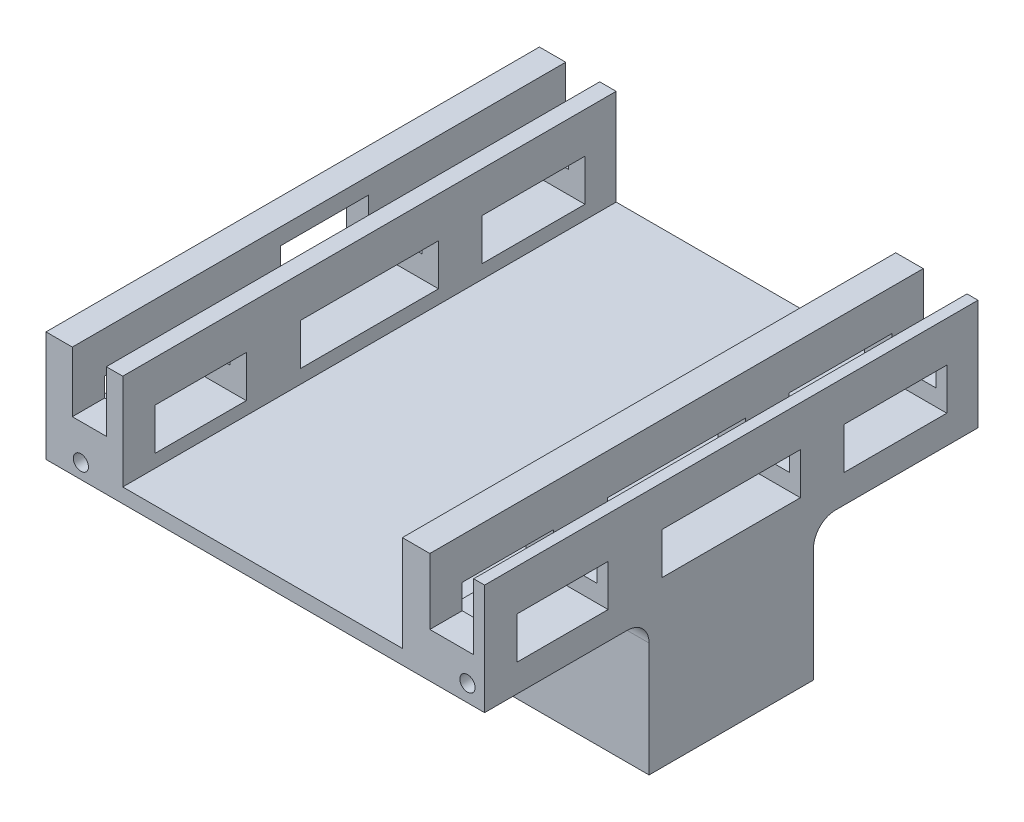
from build123d import *

# Parameters (mm, degrees)
SKETCH1_W                = 50.8
SKETCH1_H                = 19.05
BOSS_EXTRUDE1_DEPTH      = 19.05
SKETCH3_R                = 3.175
CUT_EXTRUDE1_DEPTH       = 58.501695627
SKETCH4_R                = 3.130247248
CUT_EXTRUDE3_DEPTH       = 58.501695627
SKETCH6_W                = 35.56
SKETCH6_H                = 19.05
BOSS_EXTRUDE2_DEPTH      = 9.525
BOSS_EXTRUDE3_DEPTH      = 19.05
BOSS_EXTRUDE3_DEPTH_BACK = 38.1
SKETCH7_W                = 35.56
SKETCH7_H                = 12.798350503
SKETCH8_W                = 10.5630274
SKETCH8_H                = 4.83721382
CUT_EXTRUDE4_DEPTH       = 37.846
SKETCH9_W                = 11.912020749
SKETCH9_H                = 4.826
CUT_EXTRUDE5_DEPTH       = 37.846
SKETCH10_W               = 13.208
SKETCH10_H               = 7.815498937
CUT_EXTRUDE6_DEPTH       = 204.724
SKETCH12_W               = 57.15
SKETCH12_H               = 12.798350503
SKETCH12_W_2             = 10.5630274
SKETCH12_H_2             = 4.83721382
SKETCH12_W_3             = 11.912020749
SKETCH12_H_3             = 4.826
BOSS_EXTRUDE4_DEPTH      = 7.62
SKETCH13_W               = 57.15
SKETCH13_H               = 12.798350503
SKETCH13_W_2             = 10.5630274
SKETCH13_H_2             = 4.83721382
SKETCH13_W_3             = 11.912020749
SKETCH13_H_3             = 4.826
BOSS_EXTRUDE5_DEPTH      = 7.62
CUT_EXTRUDE7_DEPTH       = 70.633186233
CUT_EXTRUDE7_DEPTH_BACK  = 70.633186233
SKETCH14_W               = 16.002
SKETCH14_H               = 4.826
SKETCH15_W               = 38.1
SKETCH15_H               = 57.15
CUT_EXTRUDE9_DEPTH       = 11.1125
SKETCH16_W               = 1.27
SKETCH16_H               = 57.15
CUT_EXTRUDE10_DEPTH      = 7.62
SKETCH17_W               = 3.937
SKETCH17_H               = 6.985
CUT_EXTRUDE12_DEPTH      = 82.628996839
SKETCH18_W               = 16.002
SKETCH18_H               = 4.826
BOSS_EXTRUDE6_DEPTH      = 3.048
SKETCH19_W               = 10.16
SKETCH19_H               = 6.35
CUT_EXTRUDE13_DEPTH      = 4.7625
FILLET1_R                = 2.54
FILLET3_R                = 2.54
SKETCH21_W               = 3.65125
SKETCH21_H               = 6.35
CUT_EXTRUDE14_DEPTH      = 0.508
SKETCH22_W               = 3.96875
SKETCH22_H               = 6.364366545
CUT_EXTRUDE15_DEPTH      = 0.508
SKETCH23_R               = 0.884360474
CUT_EXTRUDE16_DEPTH      = 5.08
SKETCH24_R               = 0.880410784
CUT_EXTRUDE17_DEPTH      = 5.08
SKETCH25_R               = 3.4925
CUT_EXTRUDE18_DEPTH      = 70.633186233
SKETCH26_W               = 57.15
SKETCH26_H               = 11.1125
BOSS_EXTRUDE8_DEPTH      = 12.192
SKETCH28_W               = 32.385
SKETCH28_H               = 11.1125
CUT_EXTRUDE19_DEPTH      = 68.58
SKETCH29_W               = 5.071446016
SKETCH29_H               = 7.62
CUT_EXTRUDE20_DEPTH      = 68.58
SKETCH30_W               = 10.5630274
SKETCH30_H               = 4.83721382
SKETCH30_W_2             = 16.002
SKETCH30_H_2             = 4.826
SKETCH30_W_3             = 11.912020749
CUT_EXTRUDE21_DEPTH      = 12.7
BOSS_EXTRUDE10_START     = -19.05
SKETCH31_R               = 3.4925
SKETCH31_R_2             = 3.302
BOSS_EXTRUDE10_DEPTH     = 19.05
BOSS_EXTRUDE12_START     = -19.05
SKETCH32_R               = 3.4925
SKETCH32_R_2             = 3.302
BOSS_EXTRUDE12_DEPTH     = 19.05


with BuildPart() as part:
    # Sketch1 → Boss-Extrude1 (new body)
    with BuildSketch(Plane.XY):
        with Locations((25.4, 9.525)):
            Rectangle(SKETCH1_W, SKETCH1_H)
    extrude(amount=BOSS_EXTRUDE1_DEPTH)

    # Sketch3 → Cut-Extrude1 (cut, through all)
    with BuildSketch(Plane.XY.offset(19.05)):
        with Locations((12.7, 9.525)):
            Circle(SKETCH3_R)
    extrude(amount=-CUT_EXTRUDE1_DEPTH, mode=Mode.SUBTRACT)

    # Sketch4 → Cut-Extrude3 (cut, through all)
    with BuildSketch(Plane.XY.offset(19.05)):
        with Locations((38.1, 9.525)):
            Circle(SKETCH4_R)
    extrude(amount=-CUT_EXTRUDE3_DEPTH, mode=Mode.SUBTRACT)

    # Sketch6 → Boss-Extrude2 (add)
    with BuildSketch(Plane(origin=(0, 19.05, 0), x_dir=(1, 0, 0), z_dir=(0, 1, 0))):
        with Locations((25.4, -9.525)):
            Rectangle(SKETCH6_W, SKETCH6_H)
    extrude(amount=BOSS_EXTRUDE2_DEPTH)

    # Sketch7 → Boss-Extrude3 (add, two sides: drawn at the far end of the back side and taken through both)
    with BuildSketch(Plane.XY.offset(19.05).offset(-BOSS_EXTRUDE3_DEPTH_BACK)):
        with Locations((25.4, 22.175824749)):
            Rectangle(SKETCH7_W, SKETCH7_H)
    extrude(amount=BOSS_EXTRUDE3_DEPTH + BOSS_EXTRUDE3_DEPTH_BACK)

    # Sketch8 → Cut-Extrude4 (cut)
    with BuildSketch(Plane(origin=(43.18, 0, 0), x_dir=(0, 0, -1), z_dir=(1, 0, 0))):
        with Locations((-29.071363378, 21.383689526)):
            Rectangle(SKETCH8_W, SKETCH8_H)
    extrude(amount=-CUT_EXTRUDE4_DEPTH, mode=Mode.SUBTRACT)

    # Sketch9 → Cut-Extrude5 (cut)
    with BuildSketch(Plane.ZY.offset(-7.62)):
        with Locations((-9.479585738, 21.463)):
            Rectangle(SKETCH9_W, SKETCH9_H)
    extrude(amount=-CUT_EXTRUDE5_DEPTH, mode=Mode.SUBTRACT)

    # Sketch10 → Cut-Extrude6 (cut)
    with BuildSketch(Plane(origin=(0, 0, -19.05), x_dir=(-1, 0, 0), z_dir=(0, 0, -1))):
        with Locations((-33.528, 22.128754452)):
            Rectangle(SKETCH10_W, SKETCH10_H)
        with Locations((-17.272, 22.128754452)):
            Rectangle(SKETCH10_W, SKETCH10_H)
    extrude(amount=-CUT_EXTRUDE6_DEPTH, mode=Mode.SUBTRACT)

    # Sketch12 → Boss-Extrude4 (add)
    with BuildSketch(Plane(origin=(43.18, 0, 0), x_dir=(0, 0, -1), z_dir=(1, 0, 0))):
        with Locations((-9.525, 22.175824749)):
            Rectangle(SKETCH12_W, SKETCH12_H)
        with Locations((-29.071363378, 21.383689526)):
            Rectangle(SKETCH12_W_2, SKETCH12_H_2, mode=Mode.SUBTRACT)
        with Locations((9.479585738, 21.463)):
            Rectangle(SKETCH12_W_3, SKETCH12_H_3, mode=Mode.SUBTRACT)
    extrude(amount=BOSS_EXTRUDE4_DEPTH)

    # Sketch13 → Boss-Extrude5 (add)
    with BuildSketch(Plane.ZY.offset(-7.62)):
        with Locations((9.525, 22.175824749)):
            Rectangle(SKETCH13_W, SKETCH13_H)
        with Locations((29.071363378, 21.383689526)):
            Rectangle(SKETCH13_W_2, SKETCH13_H_2, mode=Mode.SUBTRACT)
        with Locations((-9.479585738, 21.463)):
            Rectangle(SKETCH13_W_3, SKETCH13_H_3, mode=Mode.SUBTRACT)
    extrude(amount=BOSS_EXTRUDE5_DEPTH)

    # Sketch14 → Cut-Extrude7 (cut, two sides: drawn at the far end of the back side and taken through both)
    with BuildSketch(Plane(origin=(50.8, 0, 0), x_dir=(0, 0, -1), z_dir=(1, 0, 0)).offset(-CUT_EXTRUDE7_DEPTH_BACK)):
        with Locations((-9.525, 21.463)):
            Rectangle(SKETCH14_W, SKETCH14_H)
    extrude(amount=CUT_EXTRUDE7_DEPTH + CUT_EXTRUDE7_DEPTH_BACK, mode=Mode.SUBTRACT)

    # Sketch15 → Cut-Extrude9 (cut)
    with BuildSketch(Plane(origin=(0, 28.575, 0), x_dir=(1, 0, 0), z_dir=(0, 1, 0))):
        with Locations((27.94, -9.525)):
            Rectangle(SKETCH15_W, SKETCH15_H)
    extrude(amount=-CUT_EXTRUDE9_DEPTH, mode=Mode.SUBTRACT)

    # Sketch16 → Cut-Extrude10 (cut)
    with BuildSketch(Plane(origin=(0, 28.575, 0), x_dir=(1, 0, 0), z_dir=(0, 1, 0))):
        with Locations((48.895, -9.525)):
            Rectangle(SKETCH16_W, SKETCH16_H)
    extrude(amount=-CUT_EXTRUDE10_DEPTH, mode=Mode.SUBTRACT)

    # Sketch17 → Cut-Extrude12 (cut, through all)
    with BuildSketch(Plane.XY.offset(38.1)):
        with Locations((5.0165, 25.0825)):
            Rectangle(SKETCH17_W, SKETCH17_H)
    extrude(amount=-CUT_EXTRUDE12_DEPTH, mode=Mode.SUBTRACT)

    # Sketch18 → Boss-Extrude6 (add)
    with BuildSketch(Plane.ZY):
        with Locations((9.525, 21.463)):
            Rectangle(SKETCH18_W, SKETCH18_H)
    extrude(amount=-BOSS_EXTRUDE6_DEPTH)

    # Sketch19 → Cut-Extrude13 (cut)
    with BuildSketch(Plane.ZY):
        with Locations((8.89, 23.495)):
            Rectangle(SKETCH19_W, SKETCH19_H)
    extrude(amount=-CUT_EXTRUDE13_DEPTH, mode=Mode.SUBTRACT)

    # Fillet1
    fillet1_edges = [part.edges().sort_by_distance(p)[0] for p in [
        (25.4, 15.776649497, 0),
    ]]
    fillet(fillet1_edges, radius=FILLET1_R)

    # Fillet3
    fillet3_edges = [part.edges().sort_by_distance(p)[0] for p in [
        (25.4, 15.776649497, 19.05),
    ]]
    fillet(fillet3_edges, radius=FILLET3_R)

    # Sketch21 → Cut-Extrude14 (cut)
    with BuildSketch(Plane.ZY):
        with Locations((1.984375, 23.495)):
            Rectangle(SKETCH21_W, SKETCH21_H)
    extrude(amount=-CUT_EXTRUDE14_DEPTH, mode=Mode.SUBTRACT)

    # Sketch22 → Cut-Extrude15 (cut)
    with BuildSketch(Plane.ZY):
        with Locations((15.954375, 23.502183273)):
            Rectangle(SKETCH22_W, SKETCH22_H)
    extrude(amount=-CUT_EXTRUDE15_DEPTH, mode=Mode.SUBTRACT)

    # Sketch23 → Cut-Extrude16 (cut)
    with BuildSketch(Plane.XY.offset(38.1)):
        with Locations((48.820923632, 17.729657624)):
            Circle(SKETCH23_R)
    extrude(amount=-CUT_EXTRUDE16_DEPTH, mode=Mode.SUBTRACT)

    # Sketch24 → Cut-Extrude17 (cut)
    with BuildSketch(Plane.XY.offset(38.1)):
        with Locations((4.037534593, 17.487623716)):
            Circle(SKETCH24_R)
    extrude(amount=-CUT_EXTRUDE17_DEPTH, mode=Mode.SUBTRACT)

    # Sketch25 → Cut-Extrude18 (cut, through all)
    with BuildSketch(Plane.XY.offset(19.05)):
        with Locations((12.7, 9.525)):
            Circle(SKETCH25_R)
        with Locations((38.1, 9.525)):
            Circle(SKETCH25_R)
    extrude(amount=-CUT_EXTRUDE18_DEPTH, mode=Mode.SUBTRACT)

    # Sketch26 → Boss-Extrude8 (add)
    with BuildSketch(Plane.ZY.offset(-46.99)):
        with Locations((9.525, 23.01875)):
            Rectangle(SKETCH26_W, SKETCH26_H)
    extrude(amount=BOSS_EXTRUDE8_DEPTH)

    # Sketch28 → Cut-Extrude19 (cut)
    with BuildSketch(Plane.XY.offset(38.1)):
        with Locations((25.0825, 23.01875)):
            Rectangle(SKETCH28_W, SKETCH28_H)
    extrude(amount=-CUT_EXTRUDE19_DEPTH, mode=Mode.SUBTRACT)

    # Sketch29 → Cut-Extrude20 (cut)
    with BuildSketch(Plane.XY.offset(38.1)):
        with Locations((46.994276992, 24.765)):
            Rectangle(SKETCH29_W, SKETCH29_H)
    extrude(amount=-CUT_EXTRUDE20_DEPTH, mode=Mode.SUBTRACT)

    # Sketch30 → Cut-Extrude21 (cut)
    with BuildSketch(Plane(origin=(50.8, 0, 0), x_dir=(0, 0, -1), z_dir=(1, 0, 0))):
        with Locations((-29.071363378, 21.383689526)):
            Rectangle(SKETCH30_W, SKETCH30_H)
        with Locations((-9.525, 21.463)):
            Rectangle(SKETCH30_W_2, SKETCH30_H_2)
        with Locations((9.479585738, 21.463)):
            Rectangle(SKETCH30_W_3, SKETCH30_H_2)
    extrude(amount=-CUT_EXTRUDE21_DEPTH, mode=Mode.SUBTRACT)

    # Sketch31 → Boss-Extrude10 (add)
    with BuildSketch(Plane(origin=(0, 0, 0), x_dir=(-1, 0, 0), z_dir=(0, 0, -1)).offset(BOSS_EXTRUDE10_START)):
        with Locations((-38.1, 9.525)):
            Circle(SKETCH31_R)
        with Locations((-38.1, 9.525)):
            Circle(SKETCH31_R_2, mode=Mode.SUBTRACT)
    extrude(amount=BOSS_EXTRUDE10_DEPTH)

    # Sketch32 → Boss-Extrude12 (add)
    with BuildSketch(Plane(origin=(0, 0, 0), x_dir=(-1, 0, 0), z_dir=(0, 0, -1)).offset(BOSS_EXTRUDE12_START)):
        with Locations((-12.7, 9.525)):
            Circle(SKETCH32_R)
        with Locations((-12.7, 9.525)):
            Circle(SKETCH32_R_2, mode=Mode.SUBTRACT)
    extrude(amount=BOSS_EXTRUDE12_DEPTH)


solid = part.part
